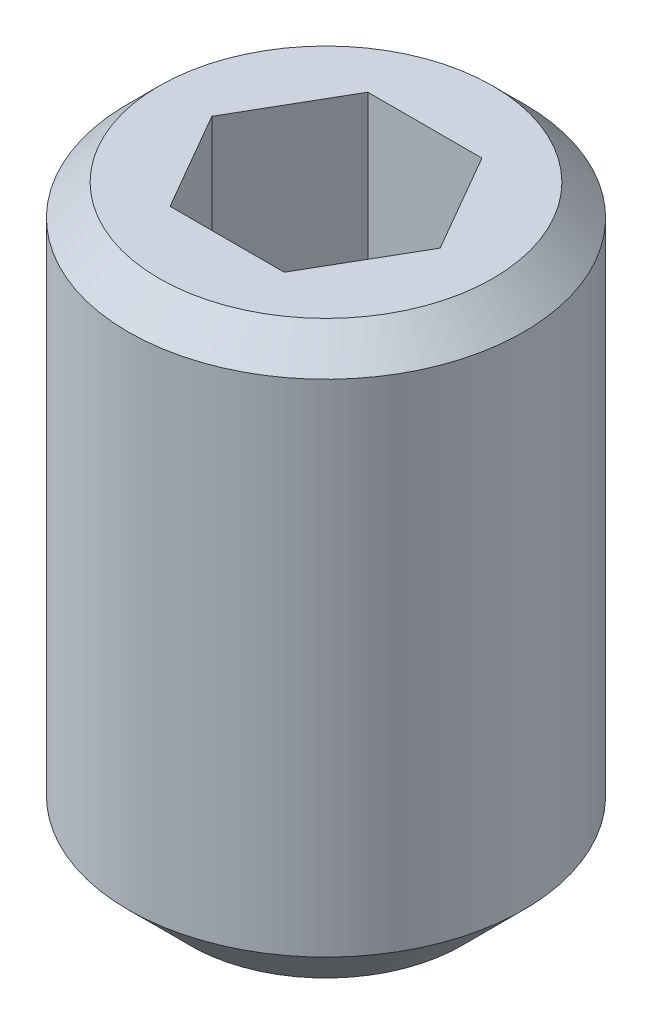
ISO-10303-21;
HEADER;
FILE_DESCRIPTION(('STEP AP214'),'2;1');
FILE_NAME('part.step','',(''),(''),'','','');
FILE_SCHEMA(('AUTOMOTIVE_DESIGN { 1 0 10303 214 1 1 1 1 }'));
ENDSEC;
DATA;
#1=APPLICATION_CONTEXT('core data for automotive mechanical design processes');
#2=APPLICATION_PROTOCOL_DEFINITION('international standard','automotive_design',2000,#1);
#3=PRODUCT_CONTEXT('',#1,'mechanical');
#4=PRODUCT('Part','Part','',(#3));
#5=PRODUCT_RELATED_PRODUCT_CATEGORY('part','',(#4));
#6=PRODUCT_DEFINITION_FORMATION('','',#4);
#7=PRODUCT_DEFINITION_CONTEXT('part definition',#1,'design');
#8=PRODUCT_DEFINITION('design','',#6,#7);
#9=PRODUCT_DEFINITION_SHAPE('','',#8);
#10=(LENGTH_UNIT() NAMED_UNIT(*) SI_UNIT(.MILLI.,.METRE.));
#11=(NAMED_UNIT(*) PLANE_ANGLE_UNIT() SI_UNIT($,.RADIAN.));
#12=(NAMED_UNIT(*) SI_UNIT($,.STERADIAN.) SOLID_ANGLE_UNIT());
#13=UNCERTAINTY_MEASURE_WITH_UNIT(LENGTH_MEASURE(1.E-05),#10,'distance_accuracy_value','');
#14=(GEOMETRIC_REPRESENTATION_CONTEXT(3) GLOBAL_UNCERTAINTY_ASSIGNED_CONTEXT((#13)) GLOBAL_UNIT_ASSIGNED_CONTEXT((#10,
#11,#12)) REPRESENTATION_CONTEXT('',''));
#15=CARTESIAN_POINT('',(0.,0.,0.));
#16=DIRECTION('',(0.,0.,1.));
#17=DIRECTION('',(1.,0.,0.));
#18=AXIS2_PLACEMENT_3D('',#15,#16,#17);
#19=CARTESIAN_POINT('',(0.,12.,0.));
#20=DIRECTION('',(0.,-1.,0.));
#21=DIRECTION('',(0.,0.,-1.));
#22=AXIS2_PLACEMENT_3D('',#19,#20,#21);
#23=CYLINDRICAL_SURFACE('',#22,4.);
#24=CARTESIAN_POINT('',(0.,11.375,0.));
#25=DIRECTION('',(0.,1.,0.));
#26=DIRECTION('',(0.,0.,1.));
#27=AXIS2_PLACEMENT_3D('',#24,#25,#26);
#28=CIRCLE('',#27,4.);
#29=CARTESIAN_POINT('',(0.,11.375,4.));
#30=VERTEX_POINT('',#29);
#31=EDGE_CURVE('E12',#30,#30,#28,.F.);
#32=ORIENTED_EDGE('',*,*,#31,.T.);
#33=EDGE_LOOP('',(#32));
#34=FACE_BOUND('',#33,.T.);
#35=CARTESIAN_POINT('',(0.,1.25,0.));
#36=DIRECTION('',(0.,1.,0.));
#37=DIRECTION('',(0.,0.,1.));
#38=AXIS2_PLACEMENT_3D('',#35,#36,#37);
#39=CIRCLE('',#38,4.);
#40=CARTESIAN_POINT('',(0.,1.25,4.));
#41=VERTEX_POINT('',#40);
#42=EDGE_CURVE('E127',#41,#41,#39,.F.);
#43=ORIENTED_EDGE('',*,*,#42,.F.);
#44=EDGE_LOOP('',(#43));
#45=FACE_BOUND('',#44,.T.);
#46=ADVANCED_FACE('F40',(#34,#45),#23,.T.);
#47=CARTESIAN_POINT('',(0.,12.,0.));
#48=DIRECTION('',(0.,1.,0.));
#49=DIRECTION('',(0.,0.,1.));
#50=AXIS2_PLACEMENT_3D('',#47,#48,#49);
#51=PLANE('',#50);
#52=CARTESIAN_POINT('',(0.,12.,0.));
#53=DIRECTION('',(0.,1.,0.));
#54=DIRECTION('',(0.,0.,1.));
#55=AXIS2_PLACEMENT_3D('',#52,#53,#54);
#56=CIRCLE('',#55,3.375);
#57=CARTESIAN_POINT('',(0.,12.,3.375));
#58=VERTEX_POINT('',#57);
#59=EDGE_CURVE('E48',#58,#58,#56,.T.);
#60=ORIENTED_EDGE('',*,*,#59,.T.);
#61=EDGE_LOOP('',(#60));
#62=FACE_BOUND('',#61,.T.);
#63=DIRECTION('',(-1.,0.,0.));
#64=VECTOR('',#63,1.);
#65=CARTESIAN_POINT('',(1.15470053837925,12.,2.));
#66=LINE('',#65,#64);
#67=CARTESIAN_POINT('',(1.15470053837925,12.,2.));
#68=VERTEX_POINT('',#67);
#69=CARTESIAN_POINT('',(-1.15470053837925,12.,2.));
#70=VERTEX_POINT('',#69);
#71=EDGE_CURVE('E136',#68,#70,#66,.T.);
#72=ORIENTED_EDGE('',*,*,#71,.T.);
#73=DIRECTION('',(-0.499999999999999,0.,-0.866025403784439));
#74=VECTOR('',#73,1.);
#75=CARTESIAN_POINT('',(-1.15470053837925,12.,2.));
#76=LINE('',#75,#74);
#77=CARTESIAN_POINT('',(-2.3094010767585,12.,0.));
#78=VERTEX_POINT('',#77);
#79=EDGE_CURVE('E55',#70,#78,#76,.T.);
#80=ORIENTED_EDGE('',*,*,#79,.T.);
#81=DIRECTION('',(0.5,0.,-0.866025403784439));
#82=VECTOR('',#81,1.);
#83=CARTESIAN_POINT('',(-2.3094010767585,12.,0.));
#84=LINE('',#83,#82);
#85=CARTESIAN_POINT('',(-1.15470053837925,12.,-2.));
#86=VERTEX_POINT('',#85);
#87=EDGE_CURVE('E126',#78,#86,#84,.T.);
#88=ORIENTED_EDGE('',*,*,#87,.T.);
#89=DIRECTION('',(1.,0.,0.));
#90=VECTOR('',#89,1.);
#91=CARTESIAN_POINT('',(-1.15470053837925,12.,-2.));
#92=LINE('',#91,#90);
#93=CARTESIAN_POINT('',(1.15470053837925,12.,-2.));
#94=VERTEX_POINT('',#93);
#95=EDGE_CURVE('E130',#86,#94,#92,.T.);
#96=ORIENTED_EDGE('',*,*,#95,.T.);
#97=DIRECTION('',(0.5,0.,0.866025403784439));
#98=VECTOR('',#97,1.);
#99=CARTESIAN_POINT('',(1.15470053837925,12.,-2.));
#100=LINE('',#99,#98);
#101=CARTESIAN_POINT('',(2.3094010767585,12.,0.));
#102=VERTEX_POINT('',#101);
#103=EDGE_CURVE('E133',#94,#102,#100,.T.);
#104=ORIENTED_EDGE('',*,*,#103,.T.);
#105=DIRECTION('',(-0.5,0.,0.866025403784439));
#106=VECTOR('',#105,1.);
#107=CARTESIAN_POINT('',(2.3094010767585,12.,0.));
#108=LINE('',#107,#106);
#109=EDGE_CURVE('E116',#102,#68,#108,.T.);
#110=ORIENTED_EDGE('',*,*,#109,.T.);
#111=EDGE_LOOP('',(#72,#80,#88,#96,#104,#110));
#112=FACE_BOUND('',#111,.T.);
#113=ADVANCED_FACE('F149',(#62,#112),#51,.T.);
#114=CARTESIAN_POINT('',(0.,12.,0.));
#115=DIRECTION('',(0.,-1.,0.));
#116=DIRECTION('',(0.,0.,-1.));
#117=AXIS2_PLACEMENT_3D('',#114,#115,#116);
#118=CONICAL_SURFACE('',#117,3.375,0.785398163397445);
#119=ORIENTED_EDGE('',*,*,#31,.F.);
#120=EDGE_LOOP('',(#119));
#121=FACE_BOUND('',#120,.T.);
#122=ORIENTED_EDGE('',*,*,#59,.F.);
#123=EDGE_LOOP('',(#122));
#124=FACE_BOUND('',#123,.T.);
#125=ADVANCED_FACE('F42',(#121,#124),#118,.T.);
#126=CARTESIAN_POINT('',(-1.15470053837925,7.,2.));
#127=DIRECTION('',(0.866025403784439,0.,-0.5));
#128=DIRECTION('',(-0.5,0.,-0.866025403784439));
#129=AXIS2_PLACEMENT_3D('',#126,#127,#128);
#130=PLANE('',#129);
#131=ORIENTED_EDGE('',*,*,#79,.F.);
#132=DIRECTION('',(0.,1.,0.));
#133=VECTOR('',#132,1.);
#134=CARTESIAN_POINT('',(-1.15470053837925,7.,2.));
#135=LINE('',#134,#133);
#136=CARTESIAN_POINT('',(-1.15470053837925,7.,2.));
#137=VERTEX_POINT('',#136);
#138=EDGE_CURVE('E121',#137,#70,#135,.T.);
#139=ORIENTED_EDGE('',*,*,#138,.F.);
#140=DIRECTION('',(-0.499999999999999,0.,-0.866025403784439));
#141=VECTOR('',#140,1.);
#142=CARTESIAN_POINT('',(-1.15470053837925,7.,2.));
#143=LINE('',#142,#141);
#144=CARTESIAN_POINT('',(-2.3094010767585,7.,0.));
#145=VERTEX_POINT('',#144);
#146=EDGE_CURVE('E139',#137,#145,#143,.T.);
#147=ORIENTED_EDGE('',*,*,#146,.T.);
#148=DIRECTION('',(0.,1.,0.));
#149=VECTOR('',#148,1.);
#150=CARTESIAN_POINT('',(-2.3094010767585,7.,0.));
#151=LINE('',#150,#149);
#152=EDGE_CURVE('E145',#145,#78,#151,.T.);
#153=ORIENTED_EDGE('',*,*,#152,.T.);
#154=EDGE_LOOP('',(#131,#139,#147,#153));
#155=FACE_BOUND('',#154,.T.);
#156=ADVANCED_FACE('F153',(#155),#130,.T.);
#157=CARTESIAN_POINT('',(-2.3094010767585,7.,0.));
#158=DIRECTION('',(0.866025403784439,0.,0.5));
#159=DIRECTION('',(0.5,0.,-0.866025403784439));
#160=AXIS2_PLACEMENT_3D('',#157,#158,#159);
#161=PLANE('',#160);
#162=ORIENTED_EDGE('',*,*,#87,.F.);
#163=ORIENTED_EDGE('',*,*,#152,.F.);
#164=DIRECTION('',(0.5,0.,-0.866025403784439));
#165=VECTOR('',#164,1.);
#166=CARTESIAN_POINT('',(-2.3094010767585,7.,0.));
#167=LINE('',#166,#165);
#168=CARTESIAN_POINT('',(-1.15470053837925,7.,-2.));
#169=VERTEX_POINT('',#168);
#170=EDGE_CURVE('E94',#145,#169,#167,.T.);
#171=ORIENTED_EDGE('',*,*,#170,.T.);
#172=DIRECTION('',(0.,1.,0.));
#173=VECTOR('',#172,1.);
#174=CARTESIAN_POINT('',(-1.15470053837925,7.,-2.));
#175=LINE('',#174,#173);
#176=EDGE_CURVE('E143',#169,#86,#175,.T.);
#177=ORIENTED_EDGE('',*,*,#176,.T.);
#178=EDGE_LOOP('',(#162,#163,#171,#177));
#179=FACE_BOUND('',#178,.T.);
#180=ADVANCED_FACE('F159',(#179),#161,.T.);
#181=CARTESIAN_POINT('',(-1.15470053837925,7.,-2.));
#182=DIRECTION('',(0.,0.,1.));
#183=DIRECTION('',(1.,0.,0.));
#184=AXIS2_PLACEMENT_3D('',#181,#182,#183);
#185=PLANE('',#184);
#186=ORIENTED_EDGE('',*,*,#95,.F.);
#187=ORIENTED_EDGE('',*,*,#176,.F.);
#188=DIRECTION('',(1.,0.,0.));
#189=VECTOR('',#188,1.);
#190=CARTESIAN_POINT('',(-1.15470053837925,7.,-2.));
#191=LINE('',#190,#189);
#192=CARTESIAN_POINT('',(1.15470053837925,7.,-2.));
#193=VERTEX_POINT('',#192);
#194=EDGE_CURVE('E112',#169,#193,#191,.T.);
#195=ORIENTED_EDGE('',*,*,#194,.T.);
#196=DIRECTION('',(0.,1.,0.));
#197=VECTOR('',#196,1.);
#198=CARTESIAN_POINT('',(1.15470053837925,7.,-2.));
#199=LINE('',#198,#197);
#200=EDGE_CURVE('E109',#193,#94,#199,.T.);
#201=ORIENTED_EDGE('',*,*,#200,.T.);
#202=EDGE_LOOP('',(#186,#187,#195,#201));
#203=FACE_BOUND('',#202,.T.);
#204=ADVANCED_FACE('F176',(#203),#185,.T.);
#205=CARTESIAN_POINT('',(1.15470053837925,7.,-2.));
#206=DIRECTION('',(-0.866025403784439,0.,0.5));
#207=DIRECTION('',(0.5,0.,0.866025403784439));
#208=AXIS2_PLACEMENT_3D('',#205,#206,#207);
#209=PLANE('',#208);
#210=ORIENTED_EDGE('',*,*,#103,.F.);
#211=ORIENTED_EDGE('',*,*,#200,.F.);
#212=DIRECTION('',(0.5,0.,0.866025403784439));
#213=VECTOR('',#212,1.);
#214=CARTESIAN_POINT('',(1.15470053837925,7.,-2.));
#215=LINE('',#214,#213);
#216=CARTESIAN_POINT('',(2.3094010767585,7.,0.));
#217=VERTEX_POINT('',#216);
#218=EDGE_CURVE('E104',#193,#217,#215,.T.);
#219=ORIENTED_EDGE('',*,*,#218,.T.);
#220=DIRECTION('',(0.,1.,0.));
#221=VECTOR('',#220,1.);
#222=CARTESIAN_POINT('',(2.3094010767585,7.,0.));
#223=LINE('',#222,#221);
#224=EDGE_CURVE('E108',#217,#102,#223,.T.);
#225=ORIENTED_EDGE('',*,*,#224,.T.);
#226=EDGE_LOOP('',(#210,#211,#219,#225));
#227=FACE_BOUND('',#226,.T.);
#228=ADVANCED_FACE('F107',(#227),#209,.T.);
#229=CARTESIAN_POINT('',(2.3094010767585,7.,0.));
#230=DIRECTION('',(-0.866025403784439,0.,-0.5));
#231=DIRECTION('',(-0.5,0.,0.866025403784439));
#232=AXIS2_PLACEMENT_3D('',#229,#230,#231);
#233=PLANE('',#232);
#234=ORIENTED_EDGE('',*,*,#109,.F.);
#235=ORIENTED_EDGE('',*,*,#224,.F.);
#236=DIRECTION('',(-0.5,0.,0.866025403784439));
#237=VECTOR('',#236,1.);
#238=CARTESIAN_POINT('',(2.3094010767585,7.,0.));
#239=LINE('',#238,#237);
#240=CARTESIAN_POINT('',(1.15470053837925,7.,2.));
#241=VERTEX_POINT('',#240);
#242=EDGE_CURVE('E111',#217,#241,#239,.T.);
#243=ORIENTED_EDGE('',*,*,#242,.T.);
#244=DIRECTION('',(0.,1.,0.));
#245=VECTOR('',#244,1.);
#246=CARTESIAN_POINT('',(1.15470053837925,7.,2.));
#247=LINE('',#246,#245);
#248=EDGE_CURVE('E85',#241,#68,#247,.T.);
#249=ORIENTED_EDGE('',*,*,#248,.T.);
#250=EDGE_LOOP('',(#234,#235,#243,#249));
#251=FACE_BOUND('',#250,.T.);
#252=ADVANCED_FACE('F114',(#251),#233,.T.);
#253=CARTESIAN_POINT('',(1.15470053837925,7.,2.));
#254=DIRECTION('',(0.,0.,-1.));
#255=DIRECTION('',(-1.,0.,0.));
#256=AXIS2_PLACEMENT_3D('',#253,#254,#255);
#257=PLANE('',#256);
#258=ORIENTED_EDGE('',*,*,#71,.F.);
#259=ORIENTED_EDGE('',*,*,#248,.F.);
#260=DIRECTION('',(-1.,0.,0.));
#261=VECTOR('',#260,1.);
#262=CARTESIAN_POINT('',(1.15470053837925,7.,2.));
#263=LINE('',#262,#261);
#264=EDGE_CURVE('E63',#241,#137,#263,.T.);
#265=ORIENTED_EDGE('',*,*,#264,.T.);
#266=ORIENTED_EDGE('',*,*,#138,.T.);
#267=EDGE_LOOP('',(#258,#259,#265,#266));
#268=FACE_BOUND('',#267,.T.);
#269=ADVANCED_FACE('F185',(#268),#257,.T.);
#270=CARTESIAN_POINT('',(-3.46410161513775,7.,-2.));
#271=DIRECTION('',(0.,-1.,0.));
#272=DIRECTION('',(0.,0.,-1.));
#273=AXIS2_PLACEMENT_3D('',#270,#271,#272);
#274=PLANE('',#273);
#275=ORIENTED_EDGE('',*,*,#146,.F.);
#276=ORIENTED_EDGE('',*,*,#264,.F.);
#277=ORIENTED_EDGE('',*,*,#242,.F.);
#278=ORIENTED_EDGE('',*,*,#218,.F.);
#279=ORIENTED_EDGE('',*,*,#194,.F.);
#280=ORIENTED_EDGE('',*,*,#170,.F.);
#281=EDGE_LOOP('',(#275,#276,#277,#278,#279,#280));
#282=FACE_BOUND('',#281,.T.);
#283=ADVANCED_FACE('F119',(#282),#274,.F.);
#284=CARTESIAN_POINT('',(0.,0.,0.));
#285=DIRECTION('',(0.,1.,0.));
#286=DIRECTION('',(0.,0.,-1.));
#287=AXIS2_PLACEMENT_3D('',#284,#285,#286);
#288=CONICAL_SURFACE('',#287,2.75,0.78539816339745);
#289=CARTESIAN_POINT('',(0.,0.,0.));
#290=DIRECTION('',(0.,-1.,0.));
#291=DIRECTION('',(0.,0.,-1.));
#292=AXIS2_PLACEMENT_3D('',#289,#290,#291);
#293=CIRCLE('',#292,2.75);
#294=CARTESIAN_POINT('',(0.,0.,-2.75));
#295=VERTEX_POINT('',#294);
#296=EDGE_CURVE('E197',#295,#295,#293,.T.);
#297=ORIENTED_EDGE('',*,*,#296,.F.);
#298=EDGE_LOOP('',(#297));
#299=FACE_BOUND('',#298,.T.);
#300=ORIENTED_EDGE('',*,*,#42,.T.);
#301=EDGE_LOOP('',(#300));
#302=FACE_BOUND('',#301,.T.);
#303=ADVANCED_FACE('F171',(#299,#302),#288,.T.);
#304=CARTESIAN_POINT('',(0.,0.,0.));
#305=DIRECTION('',(0.,1.,0.));
#306=DIRECTION('',(0.,0.,1.));
#307=AXIS2_PLACEMENT_3D('',#304,#305,#306);
#308=PLANE('',#307);
#309=ORIENTED_EDGE('',*,*,#296,.T.);
#310=EDGE_LOOP('',(#309));
#311=FACE_BOUND('',#310,.T.);
#312=ADVANCED_FACE('F169',(#311),#308,.F.);
#313=CLOSED_SHELL('',(#46,#113,#125,#156,#180,#204,#228,#252,#269,#283,#303,#312));
#314=MANIFOLD_SOLID_BREP('B2',#313);
#315=ADVANCED_BREP_SHAPE_REPRESENTATION('',(#18,#314),#14);
#316=SHAPE_DEFINITION_REPRESENTATION(#9,#315);
ENDSEC;
END-ISO-10303-21;
